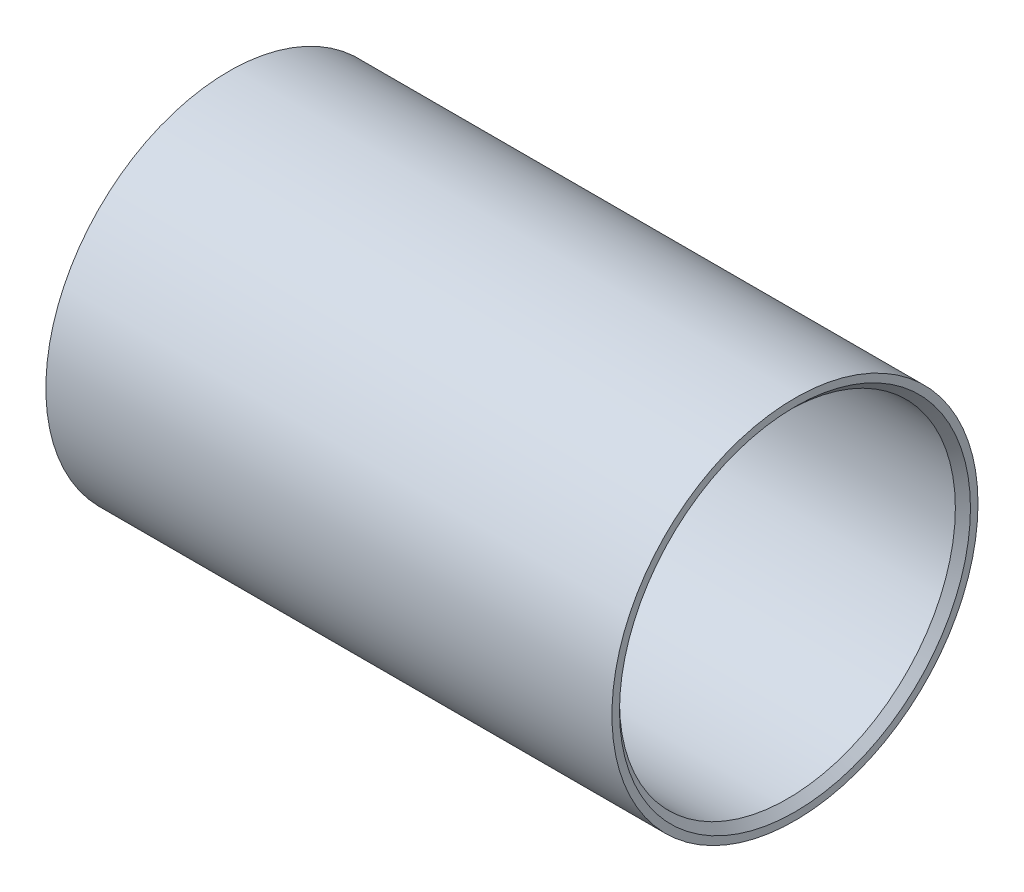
ISO-10303-21;
HEADER;
FILE_DESCRIPTION(('STEP AP214'),'2;1');
FILE_NAME('part.step','',(''),(''),'','','');
FILE_SCHEMA(('AUTOMOTIVE_DESIGN { 1 0 10303 214 1 1 1 1 }'));
ENDSEC;
DATA;
#1=APPLICATION_CONTEXT('core data for automotive mechanical design processes');
#2=APPLICATION_PROTOCOL_DEFINITION('international standard','automotive_design',2000,#1);
#3=PRODUCT_CONTEXT('',#1,'mechanical');
#4=PRODUCT('Part','Part','',(#3));
#5=PRODUCT_RELATED_PRODUCT_CATEGORY('part','',(#4));
#6=PRODUCT_DEFINITION_FORMATION('','',#4);
#7=PRODUCT_DEFINITION_CONTEXT('part definition',#1,'design');
#8=PRODUCT_DEFINITION('design','',#6,#7);
#9=PRODUCT_DEFINITION_SHAPE('','',#8);
#10=(LENGTH_UNIT() NAMED_UNIT(*) SI_UNIT(.MILLI.,.METRE.));
#11=(NAMED_UNIT(*) PLANE_ANGLE_UNIT() SI_UNIT($,.RADIAN.));
#12=(NAMED_UNIT(*) SI_UNIT($,.STERADIAN.) SOLID_ANGLE_UNIT());
#13=UNCERTAINTY_MEASURE_WITH_UNIT(LENGTH_MEASURE(1.E-05),#10,'distance_accuracy_value','');
#14=(GEOMETRIC_REPRESENTATION_CONTEXT(3) GLOBAL_UNCERTAINTY_ASSIGNED_CONTEXT((#13)) GLOBAL_UNIT_ASSIGNED_CONTEXT((#10,
#11,#12)) REPRESENTATION_CONTEXT('',''));
#15=CARTESIAN_POINT('',(0.,0.,0.));
#16=DIRECTION('',(0.,0.,1.));
#17=DIRECTION('',(1.,0.,0.));
#18=AXIS2_PLACEMENT_3D('',#15,#16,#17);
#19=CARTESIAN_POINT('',(75.,0.,0.));
#20=DIRECTION('',(1.,0.,0.));
#21=DIRECTION('',(0.,0.,-1.));
#22=AXIS2_PLACEMENT_3D('',#19,#20,#21);
#23=PLANE('',#22);
#24=CARTESIAN_POINT('',(75.,0.,0.));
#25=DIRECTION('',(1.,0.,0.));
#26=DIRECTION('',(0.,0.,-1.));
#27=AXIS2_PLACEMENT_3D('',#24,#25,#26);
#28=CIRCLE('',#27,46.5);
#29=CARTESIAN_POINT('',(75.,0.,-46.5));
#30=VERTEX_POINT('',#29);
#31=EDGE_CURVE('E10',#30,#30,#28,.F.);
#32=ORIENTED_EDGE('',*,*,#31,.T.);
#33=EDGE_LOOP('',(#32));
#34=FACE_BOUND('',#33,.T.);
#35=CARTESIAN_POINT('',(75.,0.,0.));
#36=DIRECTION('',(1.,0.,0.));
#37=DIRECTION('',(0.,0.,-1.));
#38=AXIS2_PLACEMENT_3D('',#35,#36,#37);
#39=CIRCLE('',#38,48.5);
#40=CARTESIAN_POINT('',(75.,0.,-48.5));
#41=VERTEX_POINT('',#40);
#42=EDGE_CURVE('E51',#41,#41,#39,.T.);
#43=ORIENTED_EDGE('',*,*,#42,.T.);
#44=EDGE_LOOP('',(#43));
#45=FACE_BOUND('',#44,.T.);
#46=ADVANCED_FACE('F31',(#34,#45),#23,.T.);
#47=CARTESIAN_POINT('',(-75.,0.,0.));
#48=DIRECTION('',(1.,0.,0.));
#49=DIRECTION('',(0.,0.,-1.));
#50=AXIS2_PLACEMENT_3D('',#47,#48,#49);
#51=PLANE('',#50);
#52=CARTESIAN_POINT('',(-75.,0.,0.));
#53=DIRECTION('',(1.,0.,0.));
#54=DIRECTION('',(0.,0.,-1.));
#55=AXIS2_PLACEMENT_3D('',#52,#53,#54);
#56=CIRCLE('',#55,46.5);
#57=CARTESIAN_POINT('',(-75.,0.,-46.5));
#58=VERTEX_POINT('',#57);
#59=EDGE_CURVE('E46',#58,#58,#56,.T.);
#60=ORIENTED_EDGE('',*,*,#59,.T.);
#61=EDGE_LOOP('',(#60));
#62=FACE_BOUND('',#61,.T.);
#63=CARTESIAN_POINT('',(-75.,0.,0.));
#64=DIRECTION('',(1.,0.,0.));
#65=DIRECTION('',(0.,0.,-1.));
#66=AXIS2_PLACEMENT_3D('',#63,#64,#65);
#67=CIRCLE('',#66,48.5);
#68=CARTESIAN_POINT('',(-75.,0.,-48.5));
#69=VERTEX_POINT('',#68);
#70=EDGE_CURVE('E54',#69,#69,#67,.T.);
#71=ORIENTED_EDGE('',*,*,#70,.F.);
#72=EDGE_LOOP('',(#71));
#73=FACE_BOUND('',#72,.T.);
#74=ADVANCED_FACE('F59',(#62,#73),#51,.F.);
#75=CARTESIAN_POINT('',(75.,0.,0.));
#76=DIRECTION('',(-1.,0.,0.));
#77=DIRECTION('',(0.,0.,1.));
#78=AXIS2_PLACEMENT_3D('',#75,#76,#77);
#79=CYLINDRICAL_SURFACE('',#78,48.5);
#80=ORIENTED_EDGE('',*,*,#42,.F.);
#81=EDGE_LOOP('',(#80));
#82=FACE_BOUND('',#81,.T.);
#83=ORIENTED_EDGE('',*,*,#70,.T.);
#84=EDGE_LOOP('',(#83));
#85=FACE_BOUND('',#84,.T.);
#86=ADVANCED_FACE('F33',(#82,#85),#79,.T.);
#87=CARTESIAN_POINT('',(75.,0.,0.));
#88=DIRECTION('',(-1.,0.,0.));
#89=DIRECTION('',(0.,0.,1.));
#90=AXIS2_PLACEMENT_3D('',#87,#88,#89);
#91=CYLINDRICAL_SURFACE('',#90,44.5);
#92=CARTESIAN_POINT('',(-73.,0.,0.));
#93=DIRECTION('',(1.,0.,0.));
#94=DIRECTION('',(0.,0.,-1.));
#95=AXIS2_PLACEMENT_3D('',#92,#93,#94);
#96=CIRCLE('',#95,44.5);
#97=CARTESIAN_POINT('',(-73.,0.,-44.5));
#98=VERTEX_POINT('',#97);
#99=EDGE_CURVE('E38',#98,#98,#96,.F.);
#100=ORIENTED_EDGE('',*,*,#99,.T.);
#101=EDGE_LOOP('',(#100));
#102=FACE_BOUND('',#101,.T.);
#103=CARTESIAN_POINT('',(73.,0.,0.));
#104=DIRECTION('',(1.,0.,0.));
#105=DIRECTION('',(0.,0.,-1.));
#106=AXIS2_PLACEMENT_3D('',#103,#104,#105);
#107=CIRCLE('',#106,44.5);
#108=CARTESIAN_POINT('',(73.,0.,-44.5));
#109=VERTEX_POINT('',#108);
#110=EDGE_CURVE('E42',#109,#109,#107,.T.);
#111=ORIENTED_EDGE('',*,*,#110,.T.);
#112=EDGE_LOOP('',(#111));
#113=FACE_BOUND('',#112,.T.);
#114=ADVANCED_FACE('F67',(#102,#113),#91,.F.);
#115=CARTESIAN_POINT('',(-75.,0.,0.));
#116=DIRECTION('',(-1.,0.,0.));
#117=DIRECTION('',(0.,0.,1.));
#118=AXIS2_PLACEMENT_3D('',#115,#116,#117);
#119=CONICAL_SURFACE('',#118,46.5,0.785398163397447);
#120=ORIENTED_EDGE('',*,*,#99,.F.);
#121=EDGE_LOOP('',(#120));
#122=FACE_BOUND('',#121,.T.);
#123=ORIENTED_EDGE('',*,*,#59,.F.);
#124=EDGE_LOOP('',(#123));
#125=FACE_BOUND('',#124,.T.);
#126=ADVANCED_FACE('F72',(#122,#125),#119,.F.);
#127=CARTESIAN_POINT('',(73.,0.,0.));
#128=DIRECTION('',(1.,0.,0.));
#129=DIRECTION('',(0.,0.,-1.));
#130=AXIS2_PLACEMENT_3D('',#127,#128,#129);
#131=CONICAL_SURFACE('',#130,44.5,0.785398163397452);
#132=ORIENTED_EDGE('',*,*,#31,.F.);
#133=EDGE_LOOP('',(#132));
#134=FACE_BOUND('',#133,.T.);
#135=ORIENTED_EDGE('',*,*,#110,.F.);
#136=EDGE_LOOP('',(#135));
#137=FACE_BOUND('',#136,.T.);
#138=ADVANCED_FACE('F75',(#134,#137),#131,.F.);
#139=CLOSED_SHELL('',(#46,#74,#86,#114,#126,#138));
#140=MANIFOLD_SOLID_BREP('B2',#139);
#141=ADVANCED_BREP_SHAPE_REPRESENTATION('',(#18,#140),#14);
#142=SHAPE_DEFINITION_REPRESENTATION(#9,#141);
ENDSEC;
END-ISO-10303-21;
